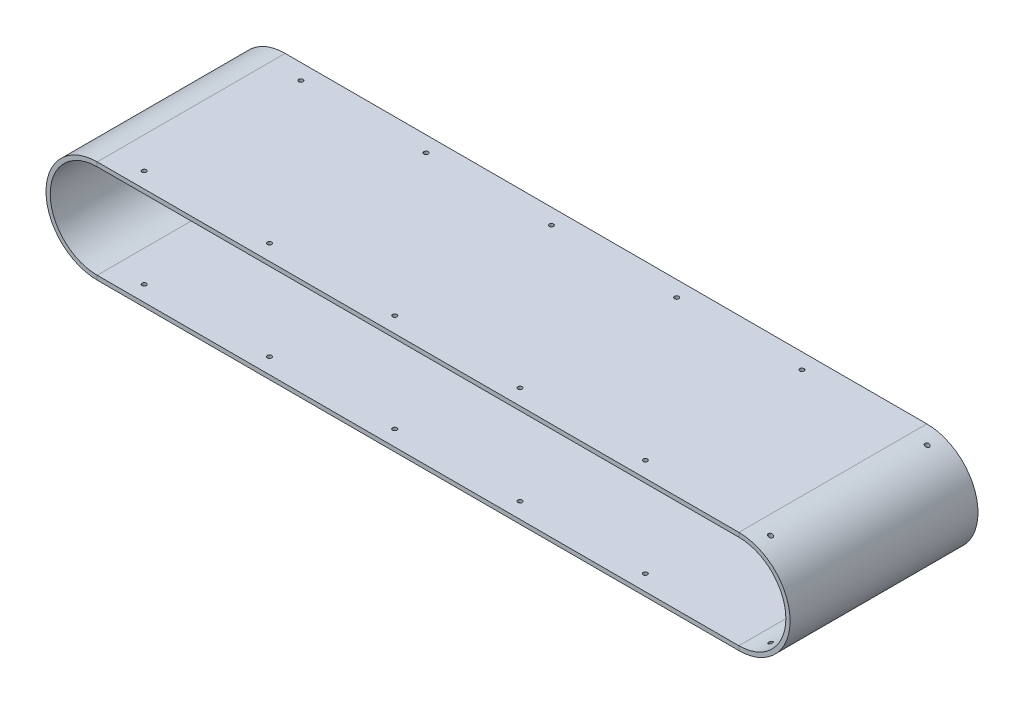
from build123d import *

# Parameters (mm, degrees)
SKETCH2_W          = 152.4
SKETCH2_H          = 3.429
SKETCH3_R          = 1.75
CUT_EXTRUDE1_DEPTH = 574.093955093


with BuildPart() as part:
    # Sweep1: sweep along a path in Sketch1
    with BuildLine(Plane.XY) as sweep1_path:
        Line((0, 39.8145), (520.371, 39.8145))
        ThreePointArc((520.371, 39.8145), (560.1855, 0), (520.371, -39.8145))
        Line((520.371, -39.8145), (0, -39.8145))
        ThreePointArc((0, -39.8145), (-39.8145, 0), (0, 39.8145))
    # Sketch2 → Sweep1 (sweep)
    with BuildSketch(Plane(origin=(0, 0, 0), x_dir=(0, 0, -1), z_dir=(1, 0, 0))):
        with Locations((0, 39.8145)):
            Rectangle(SKETCH2_W, SKETCH2_H)
    sweep(path=sweep1_path.line)

    # Sketch3 → Cut-Extrude1 (cut, through all)
    with BuildSketch(Plane(origin=(0, 41.529, 0), x_dir=(1, 0, 0), z_dir=(0, 1, 0))):
        with Locations(Location((25.4, -63.5, 0), (0, 0, 180))):
            Circle(SKETCH3_R)
        with Locations(Location((25.4, 63.5, 0), (0, 0, 180))):
            Circle(SKETCH3_R)
        with Locations(Location((127, -63.5, 0), (0, 0, 180))):
            Circle(SKETCH3_R)
        with Locations(Location((127, 63.5, 0), (0, 0, 180))):
            Circle(SKETCH3_R)
        with Locations(Location((228.6, -63.5, 0), (0, 0, 180))):
            Circle(SKETCH3_R)
        with Locations(Location((228.6, 63.5, 0), (0, 0, 180))):
            Circle(SKETCH3_R)
        with Locations(Location((330.2, -63.5, 0), (0, 0, 180))):
            Circle(SKETCH3_R)
        with Locations(Location((330.2, 63.5, 0), (0, 0, 180))):
            Circle(SKETCH3_R)
        with Locations(Location((431.8, -63.5, 0), (0, 0, 180))):
            Circle(SKETCH3_R)
        with Locations(Location((431.8, 63.5, 0), (0, 0, 180))):
            Circle(SKETCH3_R)
        with Locations(Location((533.4, -63.5, 0), (0, 0, 180))):
            Circle(SKETCH3_R)
        with Locations(Location((533.4, 63.5, 0), (0, 0, 180))):
            Circle(SKETCH3_R)
    extrude(amount=-CUT_EXTRUDE1_DEPTH, mode=Mode.SUBTRACT)


solid = part.part
